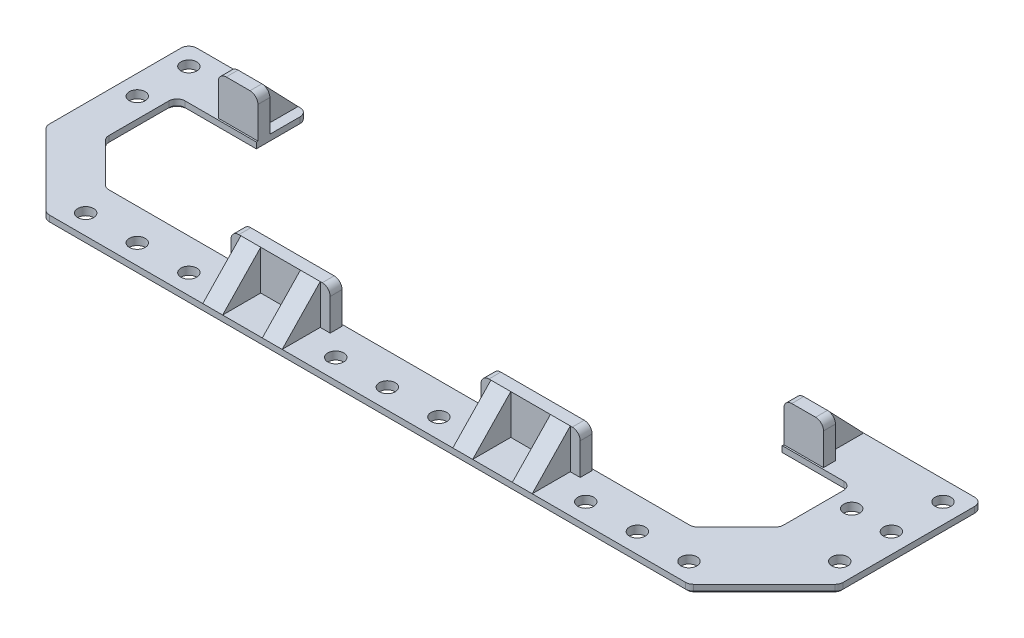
from build123d import *

# Parameters (mm, degrees)
SKETCH_2_W          = 190
SKETCH_2_H          = 29
SKETCH_2_R          = 2
EXTRUDE_1_DEPTH     = 2
CUT_EXTRUDE_1_DEPTH = 100.347873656
SKETCH_4_W          = 30
SKETCH_4_H          = 13
SKETCH_4_R          = 2
EXTRUDE_2_DEPTH     = 2
SKETCH_6_W          = 5
SKETCH_6_H          = 9.6
SKETCH_6_W_2        = 25
SKETCH_6_H_2        = 3
EXTRUDE_3_DEPTH     = 10
CUT_EXTRUDE_2_DEPTH = 176.522078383
FILLET_1_R          = 2
FILLET_3_R          = 2
CHAMFER_1_SIZE      = 0.5


with BuildPart() as part:
    # Sketch 2 → Extrude 1 (new body)
    with BuildSketch(Plane(origin=(0, 0, 0), x_dir=(1, 0, 0), z_dir=(0, 1, 0))):
        with Locations((0, 14.5)):
            Rectangle(SKETCH_2_W, SKETCH_2_H)
        with Locations(Location((90, 24, 0), (0, 0, 270))):
            Circle(SKETCH_2_R, mode=Mode.SUBTRACT)
        with Locations(Location((-90, 24, 0), (0, 0, 270))):
            Circle(SKETCH_2_R, mode=Mode.SUBTRACT)
    extrude(amount=EXTRUDE_1_DEPTH)

    # Sketch 5 → Cut-Extrude 1 (cut, through all)
    with BuildSketch(Plane(origin=(0, 2, 0), x_dir=(1, 0, 0), z_dir=(0, 1, 0))):
        Polygon((-95, 6), (-95, 0), (-89, 0), align=None)
        Polygon((-85, 29), (85, 29), (85, 11), (74, 0), (-74, 0), (-85, 11), align=None)
    extrude(amount=-CUT_EXTRUDE_1_DEPTH, mode=Mode.SUBTRACT)


with BuildPart() as cut_extrude_1_piece_1:
    # of the separate pieces the step leaves, piece 1, a body of its own (cut_extrude_1_pieces)
    add(part.part.solids().sort_by_distance((95, 0, 0))[0])



with BuildPart() as cut_extrude_1_piece_2:
    # of the separate pieces the step leaves, piece 2, a body of its own (cut_extrude_1_pieces)
    add(part.part.solids().sort_by_distance((-74, 0, 0))[0])


with BuildPart() as cut_extrude_1_piece_1_1:
    add(cut_extrude_1_piece_1.part)

    add(cut_extrude_1_piece_2.part)  # Extrude 2 merges Cut-Extrude 1 piece 2
    # Sketch 4 → Extrude 2 (add)
    # profile 1 of 2: a face of its own
    with BuildSketch(Plane(origin=(0, 0, 0), x_dir=(1, 0, 0), z_dir=(0, 1, 0))):
        with Locations((-80, 35.5)):
            Rectangle(SKETCH_4_W, SKETCH_4_H)
        with Locations(Location((-90, 37, 0), (0, 0, 270))):
            Circle(SKETCH_4_R, mode=Mode.SUBTRACT)
    # profile 2 of 2: a face of its own
    with BuildSketch(Plane(origin=(0, 0, 0), x_dir=(1, 0, 0), z_dir=(0, 1, 0))):
        Polygon((105, 42), (67.5, 42), (67.5, 29), (95, 29), (95, 0), (-89, 0), (-76, -13), (86, -13), (105, 6), align=None)
        with Locations(Location((-71, -8, 0), (0, 0, 270))):
            Circle(SKETCH_4_R, mode=Mode.SUBTRACT)
        with Locations(Location((-58, -8, 0), (0, 0, 270))):
            Circle(SKETCH_4_R, mode=Mode.SUBTRACT)
        with Locations(Location((-45, -8, 0), (0, 0, 270))):
            Circle(SKETCH_4_R, mode=Mode.SUBTRACT)
        with Locations(Location((-8, -8, 0), (0, 0, 270))):
            Circle(SKETCH_4_R, mode=Mode.SUBTRACT)
        with Locations(Location((5, -8, 0), (0, 0, 270))):
            Circle(SKETCH_4_R, mode=Mode.SUBTRACT)
        with Locations(Location((18, -8, 0), (0, 0, 270))):
            Circle(SKETCH_4_R, mode=Mode.SUBTRACT)
        with Locations(Location((55, -8, 0), (0, 0, 270))):
            Circle(SKETCH_4_R, mode=Mode.SUBTRACT)
        with Locations(Location((68, -8, 0), (0, 0, 270))):
            Circle(SKETCH_4_R, mode=Mode.SUBTRACT)
        with Locations(Location((81, -8, 0), (0, 0, 270))):
            Circle(SKETCH_4_R, mode=Mode.SUBTRACT)
        with Locations(Location((100, 11, 0), (0, 0, 270))):
            Circle(SKETCH_4_R, mode=Mode.SUBTRACT)
        with Locations(Location((100, 24, 0), (0, 0, 270))):
            Circle(SKETCH_4_R, mode=Mode.SUBTRACT)
        with Locations(Location((100, 37, 0), (0, 0, 270))):
            Circle(SKETCH_4_R, mode=Mode.SUBTRACT)
    extrude(amount=EXTRUDE_2_DEPTH)

    # Sketch 6 → Extrude 3 (add)
    with BuildSketch(Plane(origin=(0, 2, 0), x_dir=(1, 0, 0), z_dir=(0, 1, 0))):
        with Locations((-70, 37.2)):
            Rectangle(SKETCH_6_W, SKETCH_6_H)
        Polygon((-75, 32.4), (-75, 29.4), (-65, 29.4), (-65, 32.4), (-67.5, 32.4), (-72.5, 32.4), align=None)
        with Locations((-26.5, -1.9)):
            Rectangle(SKETCH_6_W_2, SKETCH_6_H_2)
        with Locations((-19, -8.2)):
            Rectangle(SKETCH_6_W, SKETCH_6_H)
        with Locations((-34, -8.2)):
            Rectangle(SKETCH_6_W, SKETCH_6_H)
        Polygon((24, -3.4), (26.5, -3.4), (31.5, -3.4), (41.5, -3.4), (46.5, -3.4), (49, -3.4), (49, -0.4), (24, -0.4), align=None)
        with Locations((29, -8.2)):
            Rectangle(SKETCH_6_W, SKETCH_6_H)
        with Locations((44, -8.2)):
            Rectangle(SKETCH_6_W, SKETCH_6_H)
        with Locations((72.5, 37.2)):
            Rectangle(SKETCH_6_W, SKETCH_6_H)
        Polygon((67.5, 32.4), (67.5, 29.4), (77.5, 29.4), (77.5, 32.4), (75, 32.4), (70, 32.4), align=None)
    extrude(amount=EXTRUDE_3_DEPTH)

    # Sketch 8 → Cut-Extrude 2 (cut, through all)
    with BuildSketch(Plane(origin=(75, 0, 0), x_dir=(0, 0, -1), z_dir=(1, 0, 0))):
        Polygon((32.4, 12), (42, 2), (42, 12), align=None)
        Polygon((-13, 12), (-13, 2), (-3.4, 12), align=None)
    extrude(amount=-CUT_EXTRUDE_2_DEPTH, mode=Mode.SUBTRACT)

    # Fillet 1
    fillet_1_edges = [cut_extrude_1_piece_1_1.edges().sort_by_distance(p)[0] for p in [
        (-75, 12, -30.9),
        (-65, 12, -30.9),
        (-14, 12, 1.9),
        (-39, 12, 1.9),
        (49, 12, 1.9),
        (24, 12, 1.9),
        (67.5, 12, -30.9),
        (77.5, 12, -30.9),
    ]]
    fillet(fillet_1_edges, radius=FILLET_1_R)

    # Fillet 3
    fillet_3_edges = [cut_extrude_1_piece_1_1.edges().sort_by_distance(p)[0] for p in [
        (105, 1, -42),
        (67.5, 1, -42),
        (85, 1, -29),
        (-74, 1, 0),
        (-85, 1, -11),
        (-85, 1, -29),
        (-65, 1, -42),
        (-95, 1, -42),
        (-95, 1, -6),
        (-76, 1, 13),
        (86, 1, 13),
        (85, 1, -11),
        (105, 1, -6),
        (74, 1, 0),
    ]]
    fillet(fillet_3_edges, radius=FILLET_3_R)

    # Chamfer 1
    chamfer_1_edges = [cut_extrude_1_piece_1_1.edges().sort_by_distance(p)[0] for p in [
        (67.5, 0, -34.5),
        (75.25, 0, -29),
        (86.25, 0, -42),
        (-85.5, 0, 3.5),
        (-95, 0, -23.414213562),
        (-80, 0, -42),
        (-65, 0, -34.5),
        (-74, 0, -29),
        (-85, 0, -19.414213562),
        (-79.5, 0, -5.5),
        (0, 0, 0),
        (79.5, 0, -5.5),
        (85, 0, -19.414213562),
        (105, 0, -23.414213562),
        (95.5, 0, 3.5),
        (5, 0, 13),
        (-94.414213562, 0, -41.414213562),
        (-65.585786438, 0, -41.414213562),
        (-94.847759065, 0, -6.06306026),
        (-75.93693974, 0, 12.847759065),
        (85.93693974, 0, 12.847759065),
        (104.847759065, 0, -6.06306026),
        (68.085786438, 0, -41.414213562),
        (104.414213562, 0, -41.414213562),
        (84.414213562, 0, -28.414213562),
        (84.847759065, 0, -11.06306026),
        (73.93693974, 0, -0.152240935),
        (-73.93693974, 0, -0.152240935),
        (-84.847759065, 0, -11.06306026),
        (-84.414213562, 0, -28.414213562),
    ]]
    chamfer(chamfer_1_edges, length=CHAMFER_1_SIZE)


solid = cut_extrude_1_piece_1_1.part
